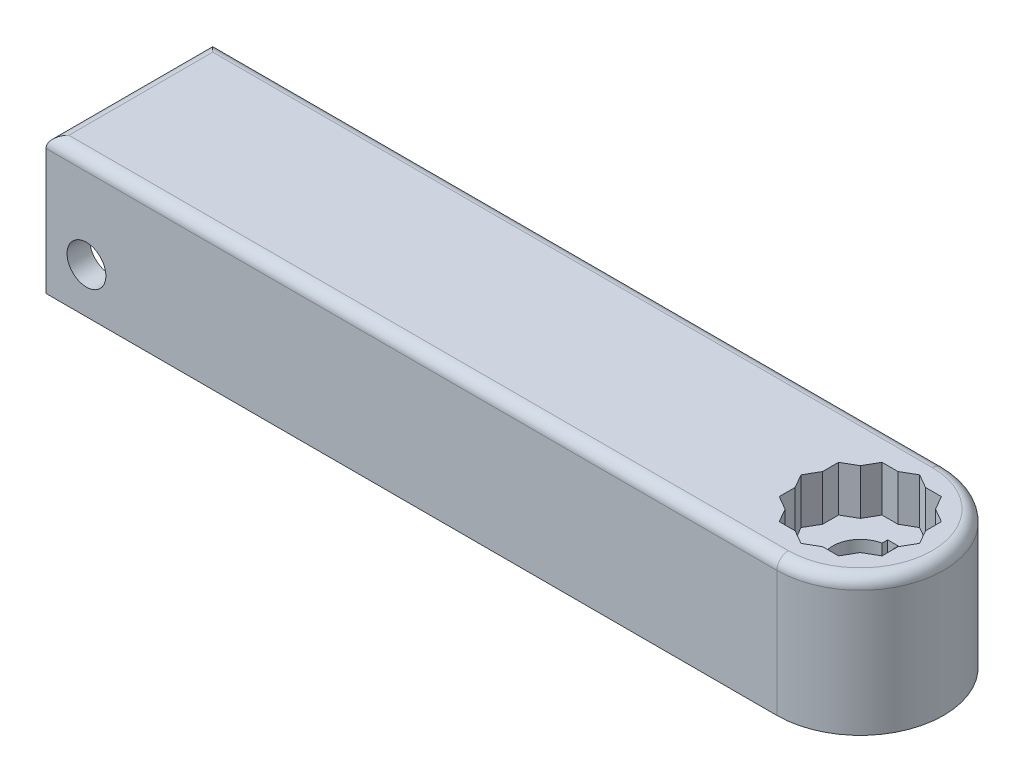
ISO-10303-21;
HEADER;
FILE_DESCRIPTION(('STEP AP214'),'2;1');
FILE_NAME('part.step','',(''),(''),'','','');
FILE_SCHEMA(('AUTOMOTIVE_DESIGN { 1 0 10303 214 1 1 1 1 }'));
ENDSEC;
DATA;
#1=APPLICATION_CONTEXT('core data for automotive mechanical design processes');
#2=APPLICATION_PROTOCOL_DEFINITION('international standard','automotive_design',2000,#1);
#3=PRODUCT_CONTEXT('',#1,'mechanical');
#4=PRODUCT('Part','Part','',(#3));
#5=PRODUCT_RELATED_PRODUCT_CATEGORY('part','',(#4));
#6=PRODUCT_DEFINITION_FORMATION('','',#4);
#7=PRODUCT_DEFINITION_CONTEXT('part definition',#1,'design');
#8=PRODUCT_DEFINITION('design','',#6,#7);
#9=PRODUCT_DEFINITION_SHAPE('','',#8);
#10=(LENGTH_UNIT() NAMED_UNIT(*) SI_UNIT(.MILLI.,.METRE.));
#11=(NAMED_UNIT(*) PLANE_ANGLE_UNIT() SI_UNIT($,.RADIAN.));
#12=(NAMED_UNIT(*) SI_UNIT($,.STERADIAN.) SOLID_ANGLE_UNIT());
#13=UNCERTAINTY_MEASURE_WITH_UNIT(LENGTH_MEASURE(1.E-05),#10,'distance_accuracy_value','');
#14=(GEOMETRIC_REPRESENTATION_CONTEXT(3) GLOBAL_UNCERTAINTY_ASSIGNED_CONTEXT((#13)) GLOBAL_UNIT_ASSIGNED_CONTEXT((#10,
#11,#12)) REPRESENTATION_CONTEXT('',''));
#15=CARTESIAN_POINT('',(0.,0.,0.));
#16=DIRECTION('',(0.,0.,1.));
#17=DIRECTION('',(1.,0.,0.));
#18=AXIS2_PLACEMENT_3D('',#15,#16,#17);
#19=CARTESIAN_POINT('',(434.975,50.8,-62.8527839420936));
#20=DIRECTION('',(0.5,0.,-0.866025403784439));
#21=DIRECTION('',(-0.866025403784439,0.,-0.5));
#22=AXIS2_PLACEMENT_3D('',#19,#20,#21);
#23=PLANE('',#22);
#24=DIRECTION('',(-0.866025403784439,0.,-0.5));
#25=VECTOR('',#24,1.);
#26=CARTESIAN_POINT('',(434.975,50.8,-62.8527839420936));
#27=LINE('',#26,#25);
#28=CARTESIAN_POINT('',(414.056648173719,50.8,-74.93));
#29=VERTEX_POINT('',#28);
#30=CARTESIAN_POINT('',(406.4,50.8,-79.3505678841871));
#31=VERTEX_POINT('',#30);
#32=EDGE_CURVE('E428',#29,#31,#27,.T.);
#33=ORIENTED_EDGE('',*,*,#32,.F.);
#34=DIRECTION('',(0.,1.,0.));
#35=VECTOR('',#34,1.);
#36=CARTESIAN_POINT('',(414.056648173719,50.8,-74.93));
#37=LINE('',#36,#35);
#38=CARTESIAN_POINT('',(414.056648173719,76.2,-74.93));
#39=VERTEX_POINT('',#38);
#40=EDGE_CURVE('E396',#29,#39,#37,.T.);
#41=ORIENTED_EDGE('',*,*,#40,.T.);
#42=DIRECTION('',(-0.866025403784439,0.,-0.5));
#43=VECTOR('',#42,1.);
#44=CARTESIAN_POINT('',(434.975,76.2,-62.8527839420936));
#45=LINE('',#44,#43);
#46=CARTESIAN_POINT('',(406.4,76.2,-79.3505678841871));
#47=VERTEX_POINT('',#46);
#48=EDGE_CURVE('E423',#39,#47,#45,.T.);
#49=ORIENTED_EDGE('',*,*,#48,.T.);
#50=DIRECTION('',(0.,1.,0.));
#51=VECTOR('',#50,1.);
#52=CARTESIAN_POINT('',(406.4,50.8,-79.3505678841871));
#53=LINE('',#52,#51);
#54=EDGE_CURVE('E448',#31,#47,#53,.T.);
#55=ORIENTED_EDGE('',*,*,#54,.F.);
#56=EDGE_LOOP('',(#33,#41,#49,#55));
#57=FACE_BOUND('',#56,.T.);
#58=ADVANCED_FACE('F31',(#57),#23,.F.);
#59=CARTESIAN_POINT('',(434.975,50.8,-29.8572160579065));
#60=DIRECTION('',(1.,0.,0.));
#61=DIRECTION('',(0.,0.,-1.));
#62=AXIS2_PLACEMENT_3D('',#59,#60,#61);
#63=PLANE('',#62);
#64=DIRECTION('',(0.,0.,-1.));
#65=VECTOR('',#64,1.);
#66=CARTESIAN_POINT('',(434.975,76.2,-29.8572160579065));
#67=LINE('',#66,#65);
#68=CARTESIAN_POINT('',(434.975,76.2,-29.8572160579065));
#69=VERTEX_POINT('',#68);
#70=CARTESIAN_POINT('',(434.975,76.2,-38.6983518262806));
#71=VERTEX_POINT('',#70);
#72=EDGE_CURVE('E469',#69,#71,#67,.T.);
#73=ORIENTED_EDGE('',*,*,#72,.T.);
#74=DIRECTION('',(0.,-1.,0.));
#75=VECTOR('',#74,1.);
#76=CARTESIAN_POINT('',(434.975,50.8,-38.6983518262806));
#77=LINE('',#76,#75);
#78=CARTESIAN_POINT('',(434.975,50.8,-38.6983518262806));
#79=VERTEX_POINT('',#78);
#80=EDGE_CURVE('E420',#71,#79,#77,.T.);
#81=ORIENTED_EDGE('',*,*,#80,.T.);
#82=DIRECTION('',(0.,0.,-1.));
#83=VECTOR('',#82,1.);
#84=CARTESIAN_POINT('',(434.975,50.8,-29.8572160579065));
#85=LINE('',#84,#83);
#86=CARTESIAN_POINT('',(434.975,50.8,-29.8572160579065));
#87=VERTEX_POINT('',#86);
#88=EDGE_CURVE('E445',#87,#79,#85,.T.);
#89=ORIENTED_EDGE('',*,*,#88,.F.);
#90=DIRECTION('',(0.,1.,0.));
#91=VECTOR('',#90,1.);
#92=CARTESIAN_POINT('',(434.975,50.8,-29.8572160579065));
#93=LINE('',#92,#91);
#94=EDGE_CURVE('E476',#87,#69,#93,.T.);
#95=ORIENTED_EDGE('',*,*,#94,.T.);
#96=EDGE_LOOP('',(#73,#81,#89,#95));
#97=FACE_BOUND('',#96,.T.);
#98=ADVANCED_FACE('F622',(#97),#63,.F.);
#99=CARTESIAN_POINT('',(406.4,50.8,-13.359432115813));
#100=DIRECTION('',(0.5,0.,0.866025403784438));
#101=DIRECTION('',(0.866025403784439,0.,-0.5));
#102=AXIS2_PLACEMENT_3D('',#99,#100,#101);
#103=PLANE('',#102);
#104=DIRECTION('',(0.866025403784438,0.,-0.5));
#105=VECTOR('',#104,1.);
#106=CARTESIAN_POINT('',(406.4,50.8,-13.359432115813));
#107=LINE('',#106,#105);
#108=CARTESIAN_POINT('',(427.318351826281,50.8,-25.4366481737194));
#109=VERTEX_POINT('',#108);
#110=EDGE_CURVE('E440',#109,#87,#107,.T.);
#111=ORIENTED_EDGE('',*,*,#110,.F.);
#112=DIRECTION('',(0.,1.,0.));
#113=VECTOR('',#112,1.);
#114=CARTESIAN_POINT('',(427.318351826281,50.8,-25.4366481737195));
#115=LINE('',#114,#113);
#116=CARTESIAN_POINT('',(427.318351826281,76.2,-25.4366481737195));
#117=VERTEX_POINT('',#116);
#118=EDGE_CURVE('E417',#109,#117,#115,.T.);
#119=ORIENTED_EDGE('',*,*,#118,.T.);
#120=DIRECTION('',(0.866025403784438,0.,-0.5));
#121=VECTOR('',#120,1.);
#122=CARTESIAN_POINT('',(406.4,76.2,-13.359432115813));
#123=LINE('',#122,#121);
#124=EDGE_CURVE('E464',#117,#69,#123,.T.);
#125=ORIENTED_EDGE('',*,*,#124,.T.);
#126=ORIENTED_EDGE('',*,*,#94,.F.);
#127=EDGE_LOOP('',(#111,#119,#125,#126));
#128=FACE_BOUND('',#127,.T.);
#129=ADVANCED_FACE('F629',(#128),#103,.F.);
#130=CARTESIAN_POINT('',(377.825,50.8,-29.8572160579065));
#131=DIRECTION('',(-0.5,0.,0.866025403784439));
#132=DIRECTION('',(0.866025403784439,0.,0.5));
#133=AXIS2_PLACEMENT_3D('',#130,#131,#132);
#134=PLANE('',#133);
#135=DIRECTION('',(0.866025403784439,0.,0.5));
#136=VECTOR('',#135,1.);
#137=CARTESIAN_POINT('',(377.825,50.8,-29.8572160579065));
#138=LINE('',#137,#136);
#139=CARTESIAN_POINT('',(398.743351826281,50.8,-17.78));
#140=VERTEX_POINT('',#139);
#141=CARTESIAN_POINT('',(406.4,50.8,-13.359432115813));
#142=VERTEX_POINT('',#141);
#143=EDGE_CURVE('E436',#140,#142,#138,.T.);
#144=ORIENTED_EDGE('',*,*,#143,.F.);
#145=DIRECTION('',(0.,1.,0.));
#146=VECTOR('',#145,1.);
#147=CARTESIAN_POINT('',(398.743351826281,50.8,-17.78));
#148=LINE('',#147,#146);
#149=CARTESIAN_POINT('',(398.743351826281,76.2,-17.78));
#150=VERTEX_POINT('',#149);
#151=EDGE_CURVE('E411',#140,#150,#148,.T.);
#152=ORIENTED_EDGE('',*,*,#151,.T.);
#153=DIRECTION('',(0.866025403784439,0.,0.5));
#154=VECTOR('',#153,1.);
#155=CARTESIAN_POINT('',(377.825,76.2,-29.8572160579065));
#156=LINE('',#155,#154);
#157=CARTESIAN_POINT('',(406.4,76.2,-13.359432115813));
#158=VERTEX_POINT('',#157);
#159=EDGE_CURVE('E460',#150,#158,#156,.T.);
#160=ORIENTED_EDGE('',*,*,#159,.T.);
#161=DIRECTION('',(0.,1.,0.));
#162=VECTOR('',#161,1.);
#163=CARTESIAN_POINT('',(406.4,50.8,-13.359432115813));
#164=LINE('',#163,#162);
#165=EDGE_CURVE('E479',#142,#158,#164,.T.);
#166=ORIENTED_EDGE('',*,*,#165,.F.);
#167=EDGE_LOOP('',(#144,#152,#160,#166));
#168=FACE_BOUND('',#167,.T.);
#169=ADVANCED_FACE('F696',(#168),#134,.F.);
#170=CARTESIAN_POINT('',(377.825,50.8,-62.8527839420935));
#171=DIRECTION('',(-1.,0.,0.));
#172=DIRECTION('',(0.,0.,1.));
#173=AXIS2_PLACEMENT_3D('',#170,#171,#172);
#174=PLANE('',#173);
#175=DIRECTION('',(0.,0.,1.));
#176=VECTOR('',#175,1.);
#177=CARTESIAN_POINT('',(377.825,50.8,-62.8527839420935));
#178=LINE('',#177,#176);
#179=CARTESIAN_POINT('',(377.825,50.8,-38.6983518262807));
#180=VERTEX_POINT('',#179);
#181=CARTESIAN_POINT('',(377.825,50.8,-29.8572160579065));
#182=VERTEX_POINT('',#181);
#183=EDGE_CURVE('E432',#180,#182,#178,.T.);
#184=ORIENTED_EDGE('',*,*,#183,.F.);
#185=DIRECTION('',(0.,1.,0.));
#186=VECTOR('',#185,1.);
#187=CARTESIAN_POINT('',(377.825,50.8,-38.6983518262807));
#188=LINE('',#187,#186);
#189=CARTESIAN_POINT('',(377.825,76.2,-38.6983518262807));
#190=VERTEX_POINT('',#189);
#191=EDGE_CURVE('E405',#180,#190,#188,.T.);
#192=ORIENTED_EDGE('',*,*,#191,.T.);
#193=DIRECTION('',(0.,0.,1.));
#194=VECTOR('',#193,1.);
#195=CARTESIAN_POINT('',(377.825,76.2,-62.8527839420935));
#196=LINE('',#195,#194);
#197=CARTESIAN_POINT('',(377.825,76.2,-29.8572160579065));
#198=VERTEX_POINT('',#197);
#199=EDGE_CURVE('E456',#190,#198,#196,.T.);
#200=ORIENTED_EDGE('',*,*,#199,.T.);
#201=DIRECTION('',(0.,1.,0.));
#202=VECTOR('',#201,1.);
#203=CARTESIAN_POINT('',(377.825,50.8,-29.8572160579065));
#204=LINE('',#203,#202);
#205=EDGE_CURVE('E482',#182,#198,#204,.T.);
#206=ORIENTED_EDGE('',*,*,#205,.F.);
#207=EDGE_LOOP('',(#184,#192,#200,#206));
#208=FACE_BOUND('',#207,.T.);
#209=ADVANCED_FACE('F714',(#208),#174,.F.);
#210=CARTESIAN_POINT('',(406.4,50.8,-79.3505678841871));
#211=DIRECTION('',(-0.500000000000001,0.,-0.866025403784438));
#212=DIRECTION('',(-0.866025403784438,0.,0.500000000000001));
#213=AXIS2_PLACEMENT_3D('',#210,#211,#212);
#214=PLANE('',#213);
#215=DIRECTION('',(-0.866025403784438,0.,0.500000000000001));
#216=VECTOR('',#215,1.);
#217=CARTESIAN_POINT('',(406.4,50.8,-79.3505678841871));
#218=LINE('',#217,#216);
#219=CARTESIAN_POINT('',(385.481648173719,50.8,-67.2733518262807));
#220=VERTEX_POINT('',#219);
#221=CARTESIAN_POINT('',(377.825,50.8,-62.8527839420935));
#222=VERTEX_POINT('',#221);
#223=EDGE_CURVE('E427',#220,#222,#218,.T.);
#224=ORIENTED_EDGE('',*,*,#223,.F.);
#225=DIRECTION('',(0.,1.,0.));
#226=VECTOR('',#225,1.);
#227=CARTESIAN_POINT('',(385.481648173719,50.8,-67.2733518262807));
#228=LINE('',#227,#226);
#229=CARTESIAN_POINT('',(385.481648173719,76.2,-67.2733518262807));
#230=VERTEX_POINT('',#229);
#231=EDGE_CURVE('E399',#220,#230,#228,.T.);
#232=ORIENTED_EDGE('',*,*,#231,.T.);
#233=DIRECTION('',(-0.866025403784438,0.,0.500000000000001));
#234=VECTOR('',#233,1.);
#235=CARTESIAN_POINT('',(406.4,76.2,-79.3505678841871));
#236=LINE('',#235,#234);
#237=CARTESIAN_POINT('',(377.825,76.2,-62.8527839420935));
#238=VERTEX_POINT('',#237);
#239=EDGE_CURVE('E452',#230,#238,#236,.T.);
#240=ORIENTED_EDGE('',*,*,#239,.T.);
#241=DIRECTION('',(0.,1.,0.));
#242=VECTOR('',#241,1.);
#243=CARTESIAN_POINT('',(377.825,50.8,-62.8527839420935));
#244=LINE('',#243,#242);
#245=EDGE_CURVE('E485',#222,#238,#244,.T.);
#246=ORIENTED_EDGE('',*,*,#245,.F.);
#247=EDGE_LOOP('',(#224,#232,#240,#246));
#248=FACE_BOUND('',#247,.T.);
#249=ADVANCED_FACE('F732',(#248),#214,.F.);
#250=CARTESIAN_POINT('',(0.,31.75,-12.7));
#251=DIRECTION('',(0.,1.,0.));
#252=DIRECTION('',(0.,0.,1.));
#253=AXIS2_PLACEMENT_3D('',#250,#251,#252);
#254=PLANE('',#253);
#255=DIRECTION('',(1.,0.,0.));
#256=VECTOR('',#255,1.);
#257=CARTESIAN_POINT('',(0.,31.75,-80.01));
#258=LINE('',#257,#256);
#259=CARTESIAN_POINT('',(0.,31.75,-80.01));
#260=VERTEX_POINT('',#259);
#261=CARTESIAN_POINT('',(13.9830837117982,31.75,-80.01));
#262=VERTEX_POINT('',#261);
#263=EDGE_CURVE('E508',#260,#262,#258,.T.);
#264=ORIENTED_EDGE('',*,*,#263,.T.);
#265=DIRECTION('',(0.,0.,1.));
#266=VECTOR('',#265,1.);
#267=CARTESIAN_POINT('',(13.9830837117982,31.75,-92.71));
#268=LINE('',#267,#266);
#269=CARTESIAN_POINT('',(13.9830837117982,31.75,-12.7));
#270=VERTEX_POINT('',#269);
#271=EDGE_CURVE('E573',#262,#270,#268,.T.);
#272=ORIENTED_EDGE('',*,*,#271,.T.);
#273=DIRECTION('',(-1.,0.,0.));
#274=VECTOR('',#273,1.);
#275=CARTESIAN_POINT('',(0.,31.75,-12.7));
#276=LINE('',#275,#274);
#277=CARTESIAN_POINT('',(0.,31.75,-12.7));
#278=VERTEX_POINT('',#277);
#279=EDGE_CURVE('E514',#270,#278,#276,.T.);
#280=ORIENTED_EDGE('',*,*,#279,.T.);
#281=DIRECTION('',(0.,0.,-1.));
#282=VECTOR('',#281,1.);
#283=CARTESIAN_POINT('',(0.,31.75,-80.01));
#284=LINE('',#283,#282);
#285=EDGE_CURVE('E504',#278,#260,#284,.T.);
#286=ORIENTED_EDGE('',*,*,#285,.T.);
#287=EDGE_LOOP('',(#264,#272,#280,#286));
#288=FACE_BOUND('',#287,.T.);
#289=ADVANCED_FACE('F753',(#288),#254,.F.);
#290=CARTESIAN_POINT('',(0.,76.2,0.));
#291=DIRECTION('',(1.,0.,0.));
#292=DIRECTION('',(0.,0.,-1.));
#293=AXIS2_PLACEMENT_3D('',#290,#291,#292);
#294=PLANE('',#293);
#295=DIRECTION('',(0.,-1.,0.));
#296=VECTOR('',#295,1.);
#297=CARTESIAN_POINT('',(0.,76.2,0.));
#298=LINE('',#297,#296);
#299=CARTESIAN_POINT('',(0.,69.85,0.));
#300=VERTEX_POINT('',#299);
#301=CARTESIAN_POINT('',(0.,0.,0.));
#302=VERTEX_POINT('',#301);
#303=EDGE_CURVE('E568',#300,#302,#298,.T.);
#304=ORIENTED_EDGE('',*,*,#303,.F.);
#305=DIRECTION('',(0.,0.,1.));
#306=VECTOR('',#305,1.);
#307=CARTESIAN_POINT('',(0.,69.85,0.));
#308=LINE('',#307,#306);
#309=CARTESIAN_POINT('',(0.,69.85,-92.71));
#310=VERTEX_POINT('',#309);
#311=EDGE_CURVE('E590',#300,#310,#308,.F.);
#312=ORIENTED_EDGE('',*,*,#311,.T.);
#313=DIRECTION('',(0.,-1.,0.));
#314=VECTOR('',#313,1.);
#315=CARTESIAN_POINT('',(0.,76.2,-92.71));
#316=LINE('',#315,#314);
#317=CARTESIAN_POINT('',(0.,0.,-92.71));
#318=VERTEX_POINT('',#317);
#319=EDGE_CURVE('E562',#310,#318,#316,.T.);
#320=ORIENTED_EDGE('',*,*,#319,.T.);
#321=DIRECTION('',(0.,0.,1.));
#322=VECTOR('',#321,1.);
#323=CARTESIAN_POINT('',(0.,0.,0.));
#324=LINE('',#323,#322);
#325=CARTESIAN_POINT('',(0.,0.,-80.01));
#326=VERTEX_POINT('',#325);
#327=EDGE_CURVE('E550',#318,#326,#324,.T.);
#328=ORIENTED_EDGE('',*,*,#327,.T.);
#329=DIRECTION('',(0.,-1.,0.));
#330=VECTOR('',#329,1.);
#331=CARTESIAN_POINT('',(0.,6.35,-80.01));
#332=LINE('',#331,#330);
#333=EDGE_CURVE('E546',#260,#326,#332,.T.);
#334=ORIENTED_EDGE('',*,*,#333,.F.);
#335=ORIENTED_EDGE('',*,*,#285,.F.);
#336=DIRECTION('',(0.,-1.,0.));
#337=VECTOR('',#336,1.);
#338=CARTESIAN_POINT('',(0.,6.35,-12.7));
#339=LINE('',#338,#337);
#340=CARTESIAN_POINT('',(0.,0.,-12.7));
#341=VERTEX_POINT('',#340);
#342=EDGE_CURVE('E534',#278,#341,#339,.T.);
#343=ORIENTED_EDGE('',*,*,#342,.T.);
#344=EDGE_CURVE('E543',#341,#302,#324,.T.);
#345=ORIENTED_EDGE('',*,*,#344,.T.);
#346=EDGE_LOOP('',(#304,#312,#320,#328,#334,#335,#343,#345));
#347=FACE_BOUND('',#346,.T.);
#348=ADVANCED_FACE('F758',(#347),#294,.F.);
#349=CARTESIAN_POINT('',(0.,76.2,0.));
#350=DIRECTION('',(0.,0.,-1.));
#351=DIRECTION('',(-1.,0.,0.));
#352=AXIS2_PLACEMENT_3D('',#349,#350,#351);
#353=PLANE('',#352);
#354=CARTESIAN_POINT('',(22.4900013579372,25.1025379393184,0.));
#355=DIRECTION('',(0.,0.,1.));
#356=DIRECTION('',(1.,0.,0.));
#357=AXIS2_PLACEMENT_3D('',#354,#355,#356);
#358=CIRCLE('',#357,10.7961289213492);
#359=CARTESIAN_POINT('',(33.2861302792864,25.1025379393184,0.));
#360=VERTEX_POINT('',#359);
#361=EDGE_CURVE('E494',#360,#360,#358,.T.);
#362=ORIENTED_EDGE('',*,*,#361,.F.);
#363=EDGE_LOOP('',(#362));
#364=FACE_BOUND('',#363,.T.);
#365=DIRECTION('',(0.,-1.,0.));
#366=VECTOR('',#365,1.);
#367=CARTESIAN_POINT('',(406.4,76.2,0.));
#368=LINE('',#367,#366);
#369=CARTESIAN_POINT('',(406.4,69.85,0.));
#370=VERTEX_POINT('',#369);
#371=CARTESIAN_POINT('',(406.4,0.,0.));
#372=VERTEX_POINT('',#371);
#373=EDGE_CURVE('E566',#370,#372,#368,.T.);
#374=ORIENTED_EDGE('',*,*,#373,.F.);
#375=DIRECTION('',(1.,0.,0.));
#376=VECTOR('',#375,1.);
#377=CARTESIAN_POINT('',(0.,69.85,0.));
#378=LINE('',#377,#376);
#379=EDGE_CURVE('E592',#370,#300,#378,.F.);
#380=ORIENTED_EDGE('',*,*,#379,.T.);
#381=ORIENTED_EDGE('',*,*,#303,.T.);
#382=DIRECTION('',(1.,0.,0.));
#383=VECTOR('',#382,1.);
#384=CARTESIAN_POINT('',(0.,0.,0.));
#385=LINE('',#384,#383);
#386=EDGE_CURVE('E553',#302,#372,#385,.T.);
#387=ORIENTED_EDGE('',*,*,#386,.T.);
#388=EDGE_LOOP('',(#374,#380,#381,#387));
#389=FACE_BOUND('',#388,.T.);
#390=ADVANCED_FACE('F908',(#364,#389),#353,.F.);
#391=CARTESIAN_POINT('',(406.4,76.2,-46.355));
#392=DIRECTION('',(0.,-1.,0.));
#393=DIRECTION('',(0.,0.,-1.));
#394=AXIS2_PLACEMENT_3D('',#391,#392,#393);
#395=CYLINDRICAL_SURFACE('',#394,46.355);
#396=DIRECTION('',(0.,-1.,0.));
#397=VECTOR('',#396,1.);
#398=CARTESIAN_POINT('',(406.4,76.2,-92.71));
#399=LINE('',#398,#397);
#400=CARTESIAN_POINT('',(406.4,69.85,-92.71));
#401=VERTEX_POINT('',#400);
#402=CARTESIAN_POINT('',(406.4,0.,-92.71));
#403=VERTEX_POINT('',#402);
#404=EDGE_CURVE('E564',#401,#403,#399,.T.);
#405=ORIENTED_EDGE('',*,*,#404,.F.);
#406=CARTESIAN_POINT('',(406.4,69.85,-46.355));
#407=DIRECTION('',(0.,-1.,0.));
#408=DIRECTION('',(0.,0.,-1.));
#409=AXIS2_PLACEMENT_3D('',#406,#407,#408);
#410=CIRCLE('',#409,46.355);
#411=EDGE_CURVE('E588',#401,#370,#410,.T.);
#412=ORIENTED_EDGE('',*,*,#411,.T.);
#413=ORIENTED_EDGE('',*,*,#373,.T.);
#414=CARTESIAN_POINT('',(406.4,0.,-46.355));
#415=DIRECTION('',(0.,1.,0.));
#416=DIRECTION('',(0.,0.,-1.));
#417=AXIS2_PLACEMENT_3D('',#414,#415,#416);
#418=CIRCLE('',#417,46.355);
#419=EDGE_CURVE('E556',#372,#403,#418,.T.);
#420=ORIENTED_EDGE('',*,*,#419,.T.);
#421=EDGE_LOOP('',(#405,#412,#413,#420));
#422=FACE_BOUND('',#421,.T.);
#423=ADVANCED_FACE('F904',(#422),#395,.T.);
#424=CARTESIAN_POINT('',(0.,76.2,-92.71));
#425=DIRECTION('',(0.,0.,1.));
#426=DIRECTION('',(1.,0.,0.));
#427=AXIS2_PLACEMENT_3D('',#424,#425,#426);
#428=PLANE('',#427);
#429=CARTESIAN_POINT('',(22.4900013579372,25.1025379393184,-92.71));
#430=DIRECTION('',(0.,0.,1.));
#431=DIRECTION('',(1.,0.,0.));
#432=AXIS2_PLACEMENT_3D('',#429,#430,#431);
#433=CIRCLE('',#432,10.7961289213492);
#434=CARTESIAN_POINT('',(33.2861302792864,25.1025379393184,-92.71));
#435=VERTEX_POINT('',#434);
#436=EDGE_CURVE('E490',#435,#435,#433,.T.);
#437=ORIENTED_EDGE('',*,*,#436,.T.);
#438=EDGE_LOOP('',(#437));
#439=FACE_BOUND('',#438,.T.);
#440=ORIENTED_EDGE('',*,*,#319,.F.);
#441=DIRECTION('',(-1.,0.,0.));
#442=VECTOR('',#441,1.);
#443=CARTESIAN_POINT('',(0.,69.85,-92.71));
#444=LINE('',#443,#442);
#445=EDGE_CURVE('E585',#310,#401,#444,.F.);
#446=ORIENTED_EDGE('',*,*,#445,.T.);
#447=ORIENTED_EDGE('',*,*,#404,.T.);
#448=DIRECTION('',(-1.,0.,0.));
#449=VECTOR('',#448,1.);
#450=CARTESIAN_POINT('',(0.,0.,-92.71));
#451=LINE('',#450,#449);
#452=EDGE_CURVE('E559',#403,#318,#451,.T.);
#453=ORIENTED_EDGE('',*,*,#452,.T.);
#454=EDGE_LOOP('',(#440,#446,#447,#453));
#455=FACE_BOUND('',#454,.T.);
#456=ADVANCED_FACE('F899',(#439,#455),#428,.F.);
#457=CARTESIAN_POINT('',(406.4,76.2,-46.355));
#458=DIRECTION('',(0.,-1.,0.));
#459=DIRECTION('',(0.,0.,-1.));
#460=AXIS2_PLACEMENT_3D('',#457,#458,#459);
#461=PLANE('',#460);
#462=ORIENTED_EDGE('',*,*,#124,.F.);
#463=DIRECTION('',(0.499999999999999,0.,-0.866025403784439));
#464=VECTOR('',#463,1.);
#465=CARTESIAN_POINT('',(422.897783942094,76.2,-17.78));
#466=LINE('',#465,#464);
#467=CARTESIAN_POINT('',(422.897783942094,76.2,-17.78));
#468=VERTEX_POINT('',#467);
#469=EDGE_CURVE('E353',#468,#117,#466,.T.);
#470=ORIENTED_EDGE('',*,*,#469,.F.);
#471=DIRECTION('',(1.,0.,0.));
#472=VECTOR('',#471,1.);
#473=CARTESIAN_POINT('',(389.902216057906,76.2,-17.78));
#474=LINE('',#473,#472);
#475=CARTESIAN_POINT('',(414.056648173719,76.2,-17.78));
#476=VERTEX_POINT('',#475);
#477=EDGE_CURVE('E367',#476,#468,#474,.T.);
#478=ORIENTED_EDGE('',*,*,#477,.F.);
#479=EDGE_CURVE('E465',#158,#476,#123,.T.);
#480=ORIENTED_EDGE('',*,*,#479,.F.);
#481=ORIENTED_EDGE('',*,*,#159,.F.);
#482=CARTESIAN_POINT('',(389.902216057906,76.2,-17.78));
#483=VERTEX_POINT('',#482);
#484=EDGE_CURVE('E368',#483,#150,#474,.T.);
#485=ORIENTED_EDGE('',*,*,#484,.F.);
#486=DIRECTION('',(0.5,0.,0.866025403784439));
#487=VECTOR('',#486,1.);
#488=CARTESIAN_POINT('',(373.404432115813,76.2,-46.355));
#489=LINE('',#488,#487);
#490=CARTESIAN_POINT('',(385.481648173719,76.2,-25.4366481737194));
#491=VERTEX_POINT('',#490);
#492=EDGE_CURVE('E364',#491,#483,#489,.T.);
#493=ORIENTED_EDGE('',*,*,#492,.F.);
#494=EDGE_CURVE('E461',#198,#491,#156,.T.);
#495=ORIENTED_EDGE('',*,*,#494,.F.);
#496=ORIENTED_EDGE('',*,*,#199,.F.);
#497=CARTESIAN_POINT('',(373.404432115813,76.2,-46.355));
#498=VERTEX_POINT('',#497);
#499=EDGE_CURVE('E365',#498,#190,#489,.T.);
#500=ORIENTED_EDGE('',*,*,#499,.F.);
#501=DIRECTION('',(-0.500000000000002,0.,0.866025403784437));
#502=VECTOR('',#501,1.);
#503=CARTESIAN_POINT('',(389.902216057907,76.2,-74.93));
#504=LINE('',#503,#502);
#505=CARTESIAN_POINT('',(377.825,76.2,-54.0116481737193));
#506=VERTEX_POINT('',#505);
#507=EDGE_CURVE('E361',#506,#498,#504,.T.);
#508=ORIENTED_EDGE('',*,*,#507,.F.);
#509=EDGE_CURVE('E457',#238,#506,#196,.T.);
#510=ORIENTED_EDGE('',*,*,#509,.F.);
#511=ORIENTED_EDGE('',*,*,#239,.F.);
#512=CARTESIAN_POINT('',(389.902216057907,76.2,-74.93));
#513=VERTEX_POINT('',#512);
#514=EDGE_CURVE('E362',#513,#230,#504,.T.);
#515=ORIENTED_EDGE('',*,*,#514,.F.);
#516=DIRECTION('',(-1.,0.,0.));
#517=VECTOR('',#516,1.);
#518=CARTESIAN_POINT('',(422.897783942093,76.2,-74.93));
#519=LINE('',#518,#517);
#520=CARTESIAN_POINT('',(398.743351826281,76.2,-74.93));
#521=VERTEX_POINT('',#520);
#522=EDGE_CURVE('E358',#521,#513,#519,.T.);
#523=ORIENTED_EDGE('',*,*,#522,.F.);
#524=EDGE_CURVE('E453',#47,#521,#236,.T.);
#525=ORIENTED_EDGE('',*,*,#524,.F.);
#526=ORIENTED_EDGE('',*,*,#48,.F.);
#527=CARTESIAN_POINT('',(422.897783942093,76.2,-74.93));
#528=VERTEX_POINT('',#527);
#529=EDGE_CURVE('E359',#528,#39,#519,.T.);
#530=ORIENTED_EDGE('',*,*,#529,.F.);
#531=DIRECTION('',(-0.5,0.,-0.866025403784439));
#532=VECTOR('',#531,1.);
#533=CARTESIAN_POINT('',(439.395567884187,76.2,-46.355));
#534=LINE('',#533,#532);
#535=CARTESIAN_POINT('',(427.318351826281,76.2,-67.2733518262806));
#536=VERTEX_POINT('',#535);
#537=EDGE_CURVE('E355',#536,#528,#534,.T.);
#538=ORIENTED_EDGE('',*,*,#537,.F.);
#539=CARTESIAN_POINT('',(434.975,76.2,-62.8527839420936));
#540=VERTEX_POINT('',#539);
#541=EDGE_CURVE('E449',#540,#536,#45,.T.);
#542=ORIENTED_EDGE('',*,*,#541,.F.);
#543=CARTESIAN_POINT('',(434.975,76.2,-54.0116481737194));
#544=VERTEX_POINT('',#543);
#545=EDGE_CURVE('E468',#544,#540,#67,.T.);
#546=ORIENTED_EDGE('',*,*,#545,.F.);
#547=CARTESIAN_POINT('',(439.395567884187,76.2,-46.355));
#548=VERTEX_POINT('',#547);
#549=EDGE_CURVE('E356',#548,#544,#534,.T.);
#550=ORIENTED_EDGE('',*,*,#549,.F.);
#551=EDGE_CURVE('E330',#71,#548,#466,.T.);
#552=ORIENTED_EDGE('',*,*,#551,.F.);
#553=ORIENTED_EDGE('',*,*,#72,.F.);
#554=EDGE_LOOP('',(#462,#470,#478,#480,#481,#485,#493,#495,#496,#500,#508,#510,#511,#515,#523,
#525,#526,#530,#538,#542,#546,#550,#552,#553));
#555=FACE_BOUND('',#554,.T.);
#556=CARTESIAN_POINT('',(406.4,76.2,-46.355));
#557=DIRECTION('',(0.,-1.,0.));
#558=DIRECTION('',(0.,0.,-1.));
#559=AXIS2_PLACEMENT_3D('',#556,#557,#558);
#560=CIRCLE('',#559,40.005);
#561=CARTESIAN_POINT('',(406.4,76.2,-6.35));
#562=VERTEX_POINT('',#561);
#563=CARTESIAN_POINT('',(406.4,76.2,-86.36));
#564=VERTEX_POINT('',#563);
#565=EDGE_CURVE('E580',#562,#564,#560,.F.);
#566=ORIENTED_EDGE('',*,*,#565,.T.);
#567=DIRECTION('',(-1.,0.,0.));
#568=VECTOR('',#567,1.);
#569=CARTESIAN_POINT('',(406.4,76.2,-86.36));
#570=LINE('',#569,#568);
#571=CARTESIAN_POINT('',(6.35000000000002,76.2,-86.36));
#572=VERTEX_POINT('',#571);
#573=EDGE_CURVE('E582',#564,#572,#570,.T.);
#574=ORIENTED_EDGE('',*,*,#573,.T.);
#575=DIRECTION('',(0.,0.,1.));
#576=VECTOR('',#575,1.);
#577=CARTESIAN_POINT('',(6.35000000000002,76.2,-46.355));
#578=LINE('',#577,#576);
#579=CARTESIAN_POINT('',(6.35000000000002,76.2,-6.35));
#580=VERTEX_POINT('',#579);
#581=EDGE_CURVE('E578',#572,#580,#578,.T.);
#582=ORIENTED_EDGE('',*,*,#581,.T.);
#583=DIRECTION('',(1.,0.,0.));
#584=VECTOR('',#583,1.);
#585=CARTESIAN_POINT('',(406.4,76.2,-6.35));
#586=LINE('',#585,#584);
#587=EDGE_CURVE('E576',#580,#562,#586,.T.);
#588=ORIENTED_EDGE('',*,*,#587,.T.);
#589=EDGE_LOOP('',(#566,#574,#582,#588));
#590=FACE_BOUND('',#589,.T.);
#591=ADVANCED_FACE('F655',(#555,#590),#461,.F.);
#592=CARTESIAN_POINT('',(406.4,0.,-46.355));
#593=DIRECTION('',(0.,-1.,0.));
#594=DIRECTION('',(0.,0.,-1.));
#595=AXIS2_PLACEMENT_3D('',#592,#593,#594);
#596=PLANE('',#595);
#597=DIRECTION('',(-1.,0.,0.));
#598=VECTOR('',#597,1.);
#599=CARTESIAN_POINT('',(406.4,0.,-12.7));
#600=LINE('',#599,#598);
#601=CARTESIAN_POINT('',(406.4,0.,-12.7));
#602=VERTEX_POINT('',#601);
#603=EDGE_CURVE('E523',#602,#341,#600,.T.);
#604=ORIENTED_EDGE('',*,*,#603,.F.);
#605=CARTESIAN_POINT('',(406.4,0.,-46.355));
#606=DIRECTION('',(0.,-1.,0.));
#607=DIRECTION('',(0.,0.,-1.));
#608=AXIS2_PLACEMENT_3D('',#605,#606,#607);
#609=CIRCLE('',#608,33.655);
#610=CARTESIAN_POINT('',(406.4,0.,-80.01));
#611=VERTEX_POINT('',#610);
#612=EDGE_CURVE('E529',#611,#602,#609,.T.);
#613=ORIENTED_EDGE('',*,*,#612,.F.);
#614=DIRECTION('',(1.,0.,0.));
#615=VECTOR('',#614,1.);
#616=CARTESIAN_POINT('',(0.,0.,-80.01));
#617=LINE('',#616,#615);
#618=EDGE_CURVE('E536',#326,#611,#617,.T.);
#619=ORIENTED_EDGE('',*,*,#618,.F.);
#620=ORIENTED_EDGE('',*,*,#327,.F.);
#621=ORIENTED_EDGE('',*,*,#452,.F.);
#622=ORIENTED_EDGE('',*,*,#419,.F.);
#623=ORIENTED_EDGE('',*,*,#386,.F.);
#624=ORIENTED_EDGE('',*,*,#344,.F.);
#625=EDGE_LOOP('',(#604,#613,#619,#620,#621,#622,#623,#624));
#626=FACE_BOUND('',#625,.T.);
#627=ADVANCED_FACE('F877',(#626),#596,.T.);
#628=CARTESIAN_POINT('',(406.4,6.35,-12.7));
#629=DIRECTION('',(0.,0.,1.));
#630=DIRECTION('',(1.,0.,0.));
#631=AXIS2_PLACEMENT_3D('',#628,#629,#630);
#632=PLANE('',#631);
#633=ORIENTED_EDGE('',*,*,#279,.F.);
#634=CARTESIAN_POINT('',(22.4900013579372,25.1025379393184,-12.7));
#635=DIRECTION('',(0.,0.,1.));
#636=DIRECTION('',(1.,0.,0.));
#637=AXIS2_PLACEMENT_3D('',#634,#635,#636);
#638=CIRCLE('',#637,10.7961289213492);
#639=CARTESIAN_POINT('',(30.9969190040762,31.75,-12.7));
#640=VERTEX_POINT('',#639);
#641=EDGE_CURVE('E500',#270,#640,#638,.T.);
#642=ORIENTED_EDGE('',*,*,#641,.T.);
#643=CARTESIAN_POINT('',(359.043879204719,31.75,-12.7));
#644=VERTEX_POINT('',#643);
#645=EDGE_CURVE('E515',#644,#640,#276,.T.);
#646=ORIENTED_EDGE('',*,*,#645,.F.);
#647=DIRECTION('',(0.,-1.,0.));
#648=VECTOR('',#647,1.);
#649=CARTESIAN_POINT('',(359.043879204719,31.75,-12.7));
#650=LINE('',#649,#648);
#651=CARTESIAN_POINT('',(359.043879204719,6.35,-12.7));
#652=VERTEX_POINT('',#651);
#653=EDGE_CURVE('E521',#644,#652,#650,.T.);
#654=ORIENTED_EDGE('',*,*,#653,.T.);
#655=DIRECTION('',(-1.,0.,0.));
#656=VECTOR('',#655,1.);
#657=CARTESIAN_POINT('',(406.4,6.35,-12.7));
#658=LINE('',#657,#656);
#659=CARTESIAN_POINT('',(406.4,6.35,-12.7));
#660=VERTEX_POINT('',#659);
#661=EDGE_CURVE('E525',#660,#652,#658,.T.);
#662=ORIENTED_EDGE('',*,*,#661,.F.);
#663=DIRECTION('',(0.,-1.,0.));
#664=VECTOR('',#663,1.);
#665=CARTESIAN_POINT('',(406.4,6.35,-12.7));
#666=LINE('',#665,#664);
#667=EDGE_CURVE('E541',#660,#602,#666,.T.);
#668=ORIENTED_EDGE('',*,*,#667,.T.);
#669=ORIENTED_EDGE('',*,*,#603,.T.);
#670=ORIENTED_EDGE('',*,*,#342,.F.);
#671=EDGE_LOOP('',(#633,#642,#646,#654,#662,#668,#669,#670));
#672=FACE_BOUND('',#671,.T.);
#673=ADVANCED_FACE('F864',(#672),#632,.F.);
#674=CARTESIAN_POINT('',(406.4,6.35,-46.355));
#675=DIRECTION('',(0.,-1.,0.));
#676=DIRECTION('',(0.,0.,-1.));
#677=AXIS2_PLACEMENT_3D('',#674,#675,#676);
#678=CYLINDRICAL_SURFACE('',#677,33.655);
#679=ORIENTED_EDGE('',*,*,#612,.T.);
#680=ORIENTED_EDGE('',*,*,#667,.F.);
#681=CARTESIAN_POINT('',(406.4,6.35,-46.355));
#682=DIRECTION('',(0.,-1.,0.));
#683=DIRECTION('',(0.,0.,-1.));
#684=AXIS2_PLACEMENT_3D('',#681,#682,#683);
#685=CIRCLE('',#684,33.655);
#686=CARTESIAN_POINT('',(406.4,6.35,-80.01));
#687=VERTEX_POINT('',#686);
#688=EDGE_CURVE('E531',#687,#660,#685,.T.);
#689=ORIENTED_EDGE('',*,*,#688,.F.);
#690=DIRECTION('',(0.,-1.,0.));
#691=VECTOR('',#690,1.);
#692=CARTESIAN_POINT('',(406.4,6.35,-80.01));
#693=LINE('',#692,#691);
#694=EDGE_CURVE('E544',#687,#611,#693,.T.);
#695=ORIENTED_EDGE('',*,*,#694,.T.);
#696=EDGE_LOOP('',(#679,#680,#689,#695));
#697=FACE_BOUND('',#696,.T.);
#698=ADVANCED_FACE('F860',(#697),#678,.F.);
#699=CARTESIAN_POINT('',(0.,6.35,-80.01));
#700=DIRECTION('',(0.,0.,-1.));
#701=DIRECTION('',(-1.,0.,0.));
#702=AXIS2_PLACEMENT_3D('',#699,#700,#701);
#703=PLANE('',#702);
#704=CARTESIAN_POINT('',(30.9969190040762,31.75,-80.01));
#705=VERTEX_POINT('',#704);
#706=CARTESIAN_POINT('',(359.043879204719,31.75,-80.01));
#707=VERTEX_POINT('',#706);
#708=EDGE_CURVE('E507',#705,#707,#258,.T.);
#709=ORIENTED_EDGE('',*,*,#708,.F.);
#710=CARTESIAN_POINT('',(22.4900013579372,25.1025379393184,-80.01));
#711=DIRECTION('',(0.,0.,-1.));
#712=DIRECTION('',(-1.,0.,0.));
#713=AXIS2_PLACEMENT_3D('',#710,#711,#712);
#714=CIRCLE('',#713,10.7961289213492);
#715=EDGE_CURVE('E493',#705,#262,#714,.T.);
#716=ORIENTED_EDGE('',*,*,#715,.T.);
#717=ORIENTED_EDGE('',*,*,#263,.F.);
#718=ORIENTED_EDGE('',*,*,#333,.T.);
#719=ORIENTED_EDGE('',*,*,#618,.T.);
#720=ORIENTED_EDGE('',*,*,#694,.F.);
#721=DIRECTION('',(1.,0.,0.));
#722=VECTOR('',#721,1.);
#723=CARTESIAN_POINT('',(0.,6.35,-80.01));
#724=LINE('',#723,#722);
#725=CARTESIAN_POINT('',(359.043879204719,6.35,-80.01));
#726=VERTEX_POINT('',#725);
#727=EDGE_CURVE('E528',#726,#687,#724,.T.);
#728=ORIENTED_EDGE('',*,*,#727,.F.);
#729=DIRECTION('',(0.,-1.,0.));
#730=VECTOR('',#729,1.);
#731=CARTESIAN_POINT('',(359.043879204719,31.75,-80.01));
#732=LINE('',#731,#730);
#733=EDGE_CURVE('E518',#707,#726,#732,.T.);
#734=ORIENTED_EDGE('',*,*,#733,.F.);
#735=EDGE_LOOP('',(#709,#716,#717,#718,#719,#720,#728,#734));
#736=FACE_BOUND('',#735,.T.);
#737=ADVANCED_FACE('F816',(#736),#703,.F.);
#738=CARTESIAN_POINT('',(406.4,6.35,-46.355));
#739=DIRECTION('',(0.,-1.,0.));
#740=DIRECTION('',(0.,0.,-1.));
#741=AXIS2_PLACEMENT_3D('',#738,#739,#740);
#742=PLANE('',#741);
#743=CARTESIAN_POINT('',(406.4,6.35,-46.355));
#744=DIRECTION('',(0.,-1.,0.));
#745=DIRECTION('',(0.,0.,-1.));
#746=AXIS2_PLACEMENT_3D('',#743,#744,#745);
#747=CIRCLE('',#746,6.64249795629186);
#748=CARTESIAN_POINT('',(406.4,6.35,-39.7125020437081));
#749=VERTEX_POINT('',#748);
#750=EDGE_CURVE('E319',#749,#749,#747,.T.);
#751=ORIENTED_EDGE('',*,*,#750,.F.);
#752=EDGE_LOOP('',(#751));
#753=FACE_BOUND('',#752,.T.);
#754=DIRECTION('',(0.,0.,1.));
#755=VECTOR('',#754,1.);
#756=CARTESIAN_POINT('',(359.043879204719,6.35,-80.01));
#757=LINE('',#756,#755);
#758=EDGE_CURVE('E503',#726,#652,#757,.T.);
#759=ORIENTED_EDGE('',*,*,#758,.F.);
#760=ORIENTED_EDGE('',*,*,#727,.T.);
#761=ORIENTED_EDGE('',*,*,#688,.T.);
#762=ORIENTED_EDGE('',*,*,#661,.T.);
#763=EDGE_LOOP('',(#759,#760,#761,#762));
#764=FACE_BOUND('',#763,.T.);
#765=ADVANCED_FACE('F810',(#753,#764),#742,.T.);
#766=CARTESIAN_POINT('',(359.043879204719,31.75,-80.01));
#767=DIRECTION('',(1.,0.,0.));
#768=DIRECTION('',(0.,0.,-1.));
#769=AXIS2_PLACEMENT_3D('',#766,#767,#768);
#770=PLANE('',#769);
#771=ORIENTED_EDGE('',*,*,#758,.T.);
#772=ORIENTED_EDGE('',*,*,#653,.F.);
#773=DIRECTION('',(0.,0.,1.));
#774=VECTOR('',#773,1.);
#775=CARTESIAN_POINT('',(359.043879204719,31.75,-80.01));
#776=LINE('',#775,#774);
#777=EDGE_CURVE('E511',#707,#644,#776,.T.);
#778=ORIENTED_EDGE('',*,*,#777,.F.);
#779=ORIENTED_EDGE('',*,*,#733,.T.);
#780=EDGE_LOOP('',(#771,#772,#778,#779));
#781=FACE_BOUND('',#780,.T.);
#782=ADVANCED_FACE('F815',(#781),#770,.F.);
#783=ORIENTED_EDGE('',*,*,#645,.T.);
#784=DIRECTION('',(0.,0.,1.));
#785=VECTOR('',#784,1.);
#786=CARTESIAN_POINT('',(30.9969190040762,31.75,-92.71));
#787=LINE('',#786,#785);
#788=EDGE_CURVE('E570',#640,#705,#787,.F.);
#789=ORIENTED_EDGE('',*,*,#788,.T.);
#790=ORIENTED_EDGE('',*,*,#708,.T.);
#791=ORIENTED_EDGE('',*,*,#777,.T.);
#792=EDGE_LOOP('',(#783,#789,#790,#791));
#793=FACE_BOUND('',#792,.T.);
#794=ADVANCED_FACE('F761',(#793),#254,.F.);
#795=CARTESIAN_POINT('',(22.4900013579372,25.1025379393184,-92.71));
#796=DIRECTION('',(0.,0.,1.));
#797=DIRECTION('',(1.,0.,0.));
#798=AXIS2_PLACEMENT_3D('',#795,#796,#797);
#799=CYLINDRICAL_SURFACE('',#798,10.7961289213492);
#800=ORIENTED_EDGE('',*,*,#361,.T.);
#801=EDGE_LOOP('',(#800));
#802=FACE_BOUND('',#801,.T.);
#803=ORIENTED_EDGE('',*,*,#436,.F.);
#804=EDGE_LOOP('',(#803));
#805=FACE_BOUND('',#804,.T.);
#806=ORIENTED_EDGE('',*,*,#715,.F.);
#807=ORIENTED_EDGE('',*,*,#788,.F.);
#808=ORIENTED_EDGE('',*,*,#641,.F.);
#809=ORIENTED_EDGE('',*,*,#271,.F.);
#810=EDGE_LOOP('',(#806,#807,#808,#809));
#811=FACE_BOUND('',#810,.T.);
#812=ADVANCED_FACE('F880',(#802,#805,#811),#799,.F.);
#813=CARTESIAN_POINT('',(406.4,69.85,-6.35));
#814=DIRECTION('',(1.,0.,0.));
#815=DIRECTION('',(0.,0.,-1.));
#816=AXIS2_PLACEMENT_3D('',#813,#814,#815);
#817=CYLINDRICAL_SURFACE('',#816,6.35);
#818=CARTESIAN_POINT('',(6.35000000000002,69.85,-6.35));
#819=DIRECTION('',(0.707106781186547,0.,0.707106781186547));
#820=DIRECTION('',(0.707106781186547,0.,-0.707106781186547));
#821=AXIS2_PLACEMENT_3D('',#818,#819,#820);
#822=ELLIPSE('',#821,8.98025612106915,6.35);
#823=EDGE_CURVE('E598',#300,#580,#822,.F.);
#824=ORIENTED_EDGE('',*,*,#823,.F.);
#825=ORIENTED_EDGE('',*,*,#379,.F.);
#826=CARTESIAN_POINT('',(406.4,69.85,-6.35));
#827=DIRECTION('',(1.,0.,0.));
#828=DIRECTION('',(0.,0.,-1.));
#829=AXIS2_PLACEMENT_3D('',#826,#827,#828);
#830=CIRCLE('',#829,6.35);
#831=EDGE_CURVE('E497',#562,#370,#830,.T.);
#832=ORIENTED_EDGE('',*,*,#831,.F.);
#833=ORIENTED_EDGE('',*,*,#587,.F.);
#834=EDGE_LOOP('',(#824,#825,#832,#833));
#835=FACE_BOUND('',#834,.T.);
#836=ADVANCED_FACE('F33',(#835),#817,.T.);
#837=CARTESIAN_POINT('',(406.4,69.85,-46.355));
#838=DIRECTION('',(0.,-1.,0.));
#839=DIRECTION('',(0.,0.,-1.));
#840=AXIS2_PLACEMENT_3D('',#837,#838,#839);
#841=TOROIDAL_SURFACE('',#840,40.005,6.35);
#842=ORIENTED_EDGE('',*,*,#831,.T.);
#843=ORIENTED_EDGE('',*,*,#411,.F.);
#844=CARTESIAN_POINT('',(406.4,69.85,-86.36));
#845=DIRECTION('',(-1.,0.,0.));
#846=DIRECTION('',(0.,0.,1.));
#847=AXIS2_PLACEMENT_3D('',#844,#845,#846);
#848=CIRCLE('',#847,6.35);
#849=EDGE_CURVE('E596',#564,#401,#848,.T.);
#850=ORIENTED_EDGE('',*,*,#849,.F.);
#851=ORIENTED_EDGE('',*,*,#565,.F.);
#852=EDGE_LOOP('',(#842,#843,#850,#851));
#853=FACE_BOUND('',#852,.T.);
#854=ADVANCED_FACE('F887',(#853),#841,.T.);
#855=CARTESIAN_POINT('',(6.35000000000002,69.85,-46.355));
#856=DIRECTION('',(0.,0.,1.));
#857=DIRECTION('',(1.,0.,0.));
#858=AXIS2_PLACEMENT_3D('',#855,#856,#857);
#859=CYLINDRICAL_SURFACE('',#858,6.35);
#860=ORIENTED_EDGE('',*,*,#823,.T.);
#861=ORIENTED_EDGE('',*,*,#581,.F.);
#862=CARTESIAN_POINT('',(6.35000000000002,69.85,-86.36));
#863=DIRECTION('',(-0.707106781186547,0.,0.707106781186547));
#864=DIRECTION('',(0.707106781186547,0.,0.707106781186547));
#865=AXIS2_PLACEMENT_3D('',#862,#863,#864);
#866=ELLIPSE('',#865,8.98025612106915,6.35);
#867=EDGE_CURVE('E475',#310,#572,#866,.F.);
#868=ORIENTED_EDGE('',*,*,#867,.F.);
#869=ORIENTED_EDGE('',*,*,#311,.F.);
#870=EDGE_LOOP('',(#860,#861,#868,#869));
#871=FACE_BOUND('',#870,.T.);
#872=ADVANCED_FACE('F645',(#871),#859,.T.);
#873=CARTESIAN_POINT('',(406.4,69.85,-86.36));
#874=DIRECTION('',(-1.,0.,0.));
#875=DIRECTION('',(0.,0.,1.));
#876=AXIS2_PLACEMENT_3D('',#873,#874,#875);
#877=CYLINDRICAL_SURFACE('',#876,6.35);
#878=ORIENTED_EDGE('',*,*,#849,.T.);
#879=ORIENTED_EDGE('',*,*,#445,.F.);
#880=ORIENTED_EDGE('',*,*,#867,.T.);
#881=ORIENTED_EDGE('',*,*,#573,.F.);
#882=EDGE_LOOP('',(#878,#879,#880,#881));
#883=FACE_BOUND('',#882,.T.);
#884=ADVANCED_FACE('F637',(#883),#877,.T.);
#885=ORIENTED_EDGE('',*,*,#541,.T.);
#886=DIRECTION('',(0.,-1.,0.));
#887=VECTOR('',#886,1.);
#888=CARTESIAN_POINT('',(427.318351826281,50.8,-67.2733518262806));
#889=LINE('',#888,#887);
#890=CARTESIAN_POINT('',(427.318351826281,50.8,-67.2733518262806));
#891=VERTEX_POINT('',#890);
#892=EDGE_CURVE('E390',#536,#891,#889,.T.);
#893=ORIENTED_EDGE('',*,*,#892,.T.);
#894=CARTESIAN_POINT('',(434.975,50.8,-62.8527839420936));
#895=VERTEX_POINT('',#894);
#896=EDGE_CURVE('E424',#895,#891,#27,.T.);
#897=ORIENTED_EDGE('',*,*,#896,.F.);
#898=DIRECTION('',(0.,1.,0.));
#899=VECTOR('',#898,1.);
#900=CARTESIAN_POINT('',(434.975,50.8,-62.8527839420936));
#901=LINE('',#900,#899);
#902=EDGE_CURVE('E472',#895,#540,#901,.T.);
#903=ORIENTED_EDGE('',*,*,#902,.T.);
#904=EDGE_LOOP('',(#885,#893,#897,#903));
#905=FACE_BOUND('',#904,.T.);
#906=ADVANCED_FACE('F625',(#905),#23,.F.);
#907=CARTESIAN_POINT('',(434.975,50.8,-54.0116481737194));
#908=VERTEX_POINT('',#907);
#909=EDGE_CURVE('E444',#908,#895,#85,.T.);
#910=ORIENTED_EDGE('',*,*,#909,.F.);
#911=DIRECTION('',(0.,1.,0.));
#912=VECTOR('',#911,1.);
#913=CARTESIAN_POINT('',(434.975,50.8,-54.0116481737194));
#914=LINE('',#913,#912);
#915=EDGE_CURVE('E373',#908,#544,#914,.T.);
#916=ORIENTED_EDGE('',*,*,#915,.T.);
#917=ORIENTED_EDGE('',*,*,#545,.T.);
#918=ORIENTED_EDGE('',*,*,#902,.F.);
#919=EDGE_LOOP('',(#910,#916,#917,#918));
#920=FACE_BOUND('',#919,.T.);
#921=ADVANCED_FACE('F632',(#920),#63,.F.);
#922=ORIENTED_EDGE('',*,*,#479,.T.);
#923=DIRECTION('',(0.,-1.,0.));
#924=VECTOR('',#923,1.);
#925=CARTESIAN_POINT('',(414.056648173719,50.8,-17.78));
#926=LINE('',#925,#924);
#927=CARTESIAN_POINT('',(414.056648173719,50.8,-17.78));
#928=VERTEX_POINT('',#927);
#929=EDGE_CURVE('E414',#476,#928,#926,.T.);
#930=ORIENTED_EDGE('',*,*,#929,.T.);
#931=EDGE_CURVE('E441',#142,#928,#107,.T.);
#932=ORIENTED_EDGE('',*,*,#931,.F.);
#933=ORIENTED_EDGE('',*,*,#165,.T.);
#934=EDGE_LOOP('',(#922,#930,#932,#933));
#935=FACE_BOUND('',#934,.T.);
#936=ADVANCED_FACE('F643',(#935),#103,.F.);
#937=ORIENTED_EDGE('',*,*,#494,.T.);
#938=DIRECTION('',(0.,-1.,0.));
#939=VECTOR('',#938,1.);
#940=CARTESIAN_POINT('',(385.481648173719,50.8,-25.4366481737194));
#941=LINE('',#940,#939);
#942=CARTESIAN_POINT('',(385.481648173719,50.8,-25.4366481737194));
#943=VERTEX_POINT('',#942);
#944=EDGE_CURVE('E408',#491,#943,#941,.T.);
#945=ORIENTED_EDGE('',*,*,#944,.T.);
#946=EDGE_CURVE('E437',#182,#943,#138,.T.);
#947=ORIENTED_EDGE('',*,*,#946,.F.);
#948=ORIENTED_EDGE('',*,*,#205,.T.);
#949=EDGE_LOOP('',(#937,#945,#947,#948));
#950=FACE_BOUND('',#949,.T.);
#951=ADVANCED_FACE('F708',(#950),#134,.F.);
#952=ORIENTED_EDGE('',*,*,#509,.T.);
#953=DIRECTION('',(0.,-1.,0.));
#954=VECTOR('',#953,1.);
#955=CARTESIAN_POINT('',(377.825,50.8,-54.0116481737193));
#956=LINE('',#955,#954);
#957=CARTESIAN_POINT('',(377.825,50.8,-54.0116481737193));
#958=VERTEX_POINT('',#957);
#959=EDGE_CURVE('E402',#506,#958,#956,.T.);
#960=ORIENTED_EDGE('',*,*,#959,.T.);
#961=EDGE_CURVE('E433',#222,#958,#178,.T.);
#962=ORIENTED_EDGE('',*,*,#961,.F.);
#963=ORIENTED_EDGE('',*,*,#245,.T.);
#964=EDGE_LOOP('',(#952,#960,#962,#963));
#965=FACE_BOUND('',#964,.T.);
#966=ADVANCED_FACE('F726',(#965),#174,.F.);
#967=ORIENTED_EDGE('',*,*,#524,.T.);
#968=DIRECTION('',(0.,-1.,0.));
#969=VECTOR('',#968,1.);
#970=CARTESIAN_POINT('',(398.743351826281,50.8,-74.93));
#971=LINE('',#970,#969);
#972=CARTESIAN_POINT('',(398.743351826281,50.8,-74.93));
#973=VERTEX_POINT('',#972);
#974=EDGE_CURVE('E393',#521,#973,#971,.T.);
#975=ORIENTED_EDGE('',*,*,#974,.T.);
#976=EDGE_CURVE('E429',#31,#973,#218,.T.);
#977=ORIENTED_EDGE('',*,*,#976,.F.);
#978=ORIENTED_EDGE('',*,*,#54,.T.);
#979=EDGE_LOOP('',(#967,#975,#977,#978));
#980=FACE_BOUND('',#979,.T.);
#981=ADVANCED_FACE('F744',(#980),#214,.F.);
#982=CARTESIAN_POINT('',(406.4,50.8,-79.3505678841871));
#983=DIRECTION('',(0.,1.,0.));
#984=DIRECTION('',(0.,0.,1.));
#985=AXIS2_PLACEMENT_3D('',#982,#983,#984);
#986=PLANE('',#985);
#987=CARTESIAN_POINT('',(406.4,50.8,-46.355));
#988=DIRECTION('',(0.,1.,0.));
#989=DIRECTION('',(0.,0.,1.));
#990=AXIS2_PLACEMENT_3D('',#987,#988,#989);
#991=CIRCLE('',#990,15.3335555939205);
#992=CARTESIAN_POINT('',(403.41829519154,50.8,-61.3958564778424));
#993=VERTEX_POINT('',#992);
#994=CARTESIAN_POINT('',(409.38170480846,50.8,-61.3958564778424));
#995=VERTEX_POINT('',#994);
#996=EDGE_CURVE('E11',#993,#995,#991,.T.);
#997=ORIENTED_EDGE('',*,*,#996,.F.);
#998=DIRECTION('',(0.,0.,1.));
#999=VECTOR('',#998,1.);
#1000=CARTESIAN_POINT('',(403.41829519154,50.8,-79.3505678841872));
#1001=LINE('',#1000,#999);
#1002=CARTESIAN_POINT('',(403.41829519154,50.8,-64.5708564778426));
#1003=VERTEX_POINT('',#1002);
#1004=EDGE_CURVE('E39',#1003,#993,#1001,.T.);
#1005=ORIENTED_EDGE('',*,*,#1004,.F.);
#1006=DIRECTION('',(-1.,0.,0.));
#1007=VECTOR('',#1006,1.);
#1008=CARTESIAN_POINT('',(406.4,50.8,-64.5708564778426));
#1009=LINE('',#1008,#1007);
#1010=CARTESIAN_POINT('',(409.38170480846,50.8,-64.5708564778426));
#1011=VERTEX_POINT('',#1010);
#1012=EDGE_CURVE('E604',#1011,#1003,#1009,.T.);
#1013=ORIENTED_EDGE('',*,*,#1012,.F.);
#1014=DIRECTION('',(0.,0.,-1.));
#1015=VECTOR('',#1014,1.);
#1016=CARTESIAN_POINT('',(409.38170480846,50.8,-79.3505678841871));
#1017=LINE('',#1016,#1015);
#1018=EDGE_CURVE('E594',#995,#1011,#1017,.T.);
#1019=ORIENTED_EDGE('',*,*,#1018,.F.);
#1020=EDGE_LOOP('',(#997,#1005,#1013,#1019));
#1021=FACE_BOUND('',#1020,.T.);
#1022=ORIENTED_EDGE('',*,*,#896,.T.);
#1023=DIRECTION('',(-0.5,0.,-0.866025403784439));
#1024=VECTOR('',#1023,1.);
#1025=CARTESIAN_POINT('',(439.395567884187,50.8,-46.355));
#1026=LINE('',#1025,#1024);
#1027=CARTESIAN_POINT('',(422.897783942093,50.8,-74.93));
#1028=VERTEX_POINT('',#1027);
#1029=EDGE_CURVE('E337',#891,#1028,#1026,.T.);
#1030=ORIENTED_EDGE('',*,*,#1029,.T.);
#1031=DIRECTION('',(-1.,0.,0.));
#1032=VECTOR('',#1031,1.);
#1033=CARTESIAN_POINT('',(422.897783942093,50.8,-74.93));
#1034=LINE('',#1033,#1032);
#1035=EDGE_CURVE('E341',#1028,#29,#1034,.T.);
#1036=ORIENTED_EDGE('',*,*,#1035,.T.);
#1037=ORIENTED_EDGE('',*,*,#32,.T.);
#1038=ORIENTED_EDGE('',*,*,#976,.T.);
#1039=CARTESIAN_POINT('',(389.902216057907,50.8,-74.93));
#1040=VERTEX_POINT('',#1039);
#1041=EDGE_CURVE('E340',#973,#1040,#1034,.T.);
#1042=ORIENTED_EDGE('',*,*,#1041,.T.);
#1043=DIRECTION('',(-0.500000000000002,0.,0.866025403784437));
#1044=VECTOR('',#1043,1.);
#1045=CARTESIAN_POINT('',(389.902216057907,50.8,-74.93));
#1046=LINE('',#1045,#1044);
#1047=EDGE_CURVE('E344',#1040,#220,#1046,.T.);
#1048=ORIENTED_EDGE('',*,*,#1047,.T.);
#1049=ORIENTED_EDGE('',*,*,#223,.T.);
#1050=ORIENTED_EDGE('',*,*,#961,.T.);
#1051=CARTESIAN_POINT('',(373.404432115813,50.8,-46.355));
#1052=VERTEX_POINT('',#1051);
#1053=EDGE_CURVE('E343',#958,#1052,#1046,.T.);
#1054=ORIENTED_EDGE('',*,*,#1053,.T.);
#1055=DIRECTION('',(0.5,0.,0.866025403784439));
#1056=VECTOR('',#1055,1.);
#1057=CARTESIAN_POINT('',(373.404432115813,50.8,-46.355));
#1058=LINE('',#1057,#1056);
#1059=EDGE_CURVE('E347',#1052,#180,#1058,.T.);
#1060=ORIENTED_EDGE('',*,*,#1059,.T.);
#1061=ORIENTED_EDGE('',*,*,#183,.T.);
#1062=ORIENTED_EDGE('',*,*,#946,.T.);
#1063=CARTESIAN_POINT('',(389.902216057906,50.8,-17.78));
#1064=VERTEX_POINT('',#1063);
#1065=EDGE_CURVE('E346',#943,#1064,#1058,.T.);
#1066=ORIENTED_EDGE('',*,*,#1065,.T.);
#1067=DIRECTION('',(1.,0.,0.));
#1068=VECTOR('',#1067,1.);
#1069=CARTESIAN_POINT('',(389.902216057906,50.8,-17.78));
#1070=LINE('',#1069,#1068);
#1071=EDGE_CURVE('E350',#1064,#140,#1070,.T.);
#1072=ORIENTED_EDGE('',*,*,#1071,.T.);
#1073=ORIENTED_EDGE('',*,*,#143,.T.);
#1074=ORIENTED_EDGE('',*,*,#931,.T.);
#1075=CARTESIAN_POINT('',(422.897783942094,50.8,-17.78));
#1076=VERTEX_POINT('',#1075);
#1077=EDGE_CURVE('E349',#928,#1076,#1070,.T.);
#1078=ORIENTED_EDGE('',*,*,#1077,.T.);
#1079=DIRECTION('',(0.499999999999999,0.,-0.866025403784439));
#1080=VECTOR('',#1079,1.);
#1081=CARTESIAN_POINT('',(422.897783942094,50.8,-17.78));
#1082=LINE('',#1081,#1080);
#1083=EDGE_CURVE('E335',#1076,#109,#1082,.T.);
#1084=ORIENTED_EDGE('',*,*,#1083,.T.);
#1085=ORIENTED_EDGE('',*,*,#110,.T.);
#1086=ORIENTED_EDGE('',*,*,#88,.T.);
#1087=CARTESIAN_POINT('',(439.395567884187,50.8,-46.355));
#1088=VERTEX_POINT('',#1087);
#1089=EDGE_CURVE('E338',#79,#1088,#1082,.T.);
#1090=ORIENTED_EDGE('',*,*,#1089,.T.);
#1091=EDGE_CURVE('E53',#1088,#908,#1026,.T.);
#1092=ORIENTED_EDGE('',*,*,#1091,.T.);
#1093=ORIENTED_EDGE('',*,*,#909,.T.);
#1094=EDGE_LOOP('',(#1022,#1030,#1036,#1037,#1038,#1042,#1048,#1049,#1050,#1054,#1060,#1061,
#1062,#1066,#1072,#1073,#1074,#1078,#1084,#1085,#1086,#1090,#1092,#1093));
#1095=FACE_BOUND('',#1094,.T.);
#1096=ADVANCED_FACE('F610',(#1021,#1095),#986,.T.);
#1097=CARTESIAN_POINT('',(422.897783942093,50.8,-74.93));
#1098=DIRECTION('',(0.,0.,-1.));
#1099=DIRECTION('',(-1.,0.,0.));
#1100=AXIS2_PLACEMENT_3D('',#1097,#1098,#1099);
#1101=PLANE('',#1100);
#1102=ORIENTED_EDGE('',*,*,#522,.T.);
#1103=DIRECTION('',(0.,1.,0.));
#1104=VECTOR('',#1103,1.);
#1105=CARTESIAN_POINT('',(389.902216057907,50.8,-74.93));
#1106=LINE('',#1105,#1104);
#1107=EDGE_CURVE('E380',#1040,#513,#1106,.T.);
#1108=ORIENTED_EDGE('',*,*,#1107,.F.);
#1109=ORIENTED_EDGE('',*,*,#1041,.F.);
#1110=ORIENTED_EDGE('',*,*,#974,.F.);
#1111=EDGE_LOOP('',(#1102,#1108,#1109,#1110));
#1112=FACE_BOUND('',#1111,.T.);
#1113=ADVANCED_FACE('F741',(#1112),#1101,.F.);
#1114=CARTESIAN_POINT('',(389.902216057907,50.8,-74.93));
#1115=DIRECTION('',(-0.866025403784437,0.,-0.500000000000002));
#1116=DIRECTION('',(-0.500000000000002,0.,0.866025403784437));
#1117=AXIS2_PLACEMENT_3D('',#1114,#1115,#1116);
#1118=PLANE('',#1117);
#1119=ORIENTED_EDGE('',*,*,#1047,.F.);
#1120=ORIENTED_EDGE('',*,*,#1107,.T.);
#1121=ORIENTED_EDGE('',*,*,#514,.T.);
#1122=ORIENTED_EDGE('',*,*,#231,.F.);
#1123=EDGE_LOOP('',(#1119,#1120,#1121,#1122));
#1124=FACE_BOUND('',#1123,.T.);
#1125=ADVANCED_FACE('F738',(#1124),#1118,.F.);
#1126=ORIENTED_EDGE('',*,*,#507,.T.);
#1127=DIRECTION('',(0.,1.,0.));
#1128=VECTOR('',#1127,1.);
#1129=CARTESIAN_POINT('',(373.404432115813,50.8,-46.355));
#1130=LINE('',#1129,#1128);
#1131=EDGE_CURVE('E377',#1052,#498,#1130,.T.);
#1132=ORIENTED_EDGE('',*,*,#1131,.F.);
#1133=ORIENTED_EDGE('',*,*,#1053,.F.);
#1134=ORIENTED_EDGE('',*,*,#959,.F.);
#1135=EDGE_LOOP('',(#1126,#1132,#1133,#1134));
#1136=FACE_BOUND('',#1135,.T.);
#1137=ADVANCED_FACE('F723',(#1136),#1118,.F.);
#1138=CARTESIAN_POINT('',(373.404432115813,50.8,-46.355));
#1139=DIRECTION('',(-0.866025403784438,0.,0.5));
#1140=DIRECTION('',(0.5,0.,0.866025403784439));
#1141=AXIS2_PLACEMENT_3D('',#1138,#1139,#1140);
#1142=PLANE('',#1141);
#1143=ORIENTED_EDGE('',*,*,#1059,.F.);
#1144=ORIENTED_EDGE('',*,*,#1131,.T.);
#1145=ORIENTED_EDGE('',*,*,#499,.T.);
#1146=ORIENTED_EDGE('',*,*,#191,.F.);
#1147=EDGE_LOOP('',(#1143,#1144,#1145,#1146));
#1148=FACE_BOUND('',#1147,.T.);
#1149=ADVANCED_FACE('F720',(#1148),#1142,.F.);
#1150=ORIENTED_EDGE('',*,*,#492,.T.);
#1151=DIRECTION('',(0.,1.,0.));
#1152=VECTOR('',#1151,1.);
#1153=CARTESIAN_POINT('',(389.902216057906,50.8,-17.78));
#1154=LINE('',#1153,#1152);
#1155=EDGE_CURVE('E374',#1064,#483,#1154,.T.);
#1156=ORIENTED_EDGE('',*,*,#1155,.F.);
#1157=ORIENTED_EDGE('',*,*,#1065,.F.);
#1158=ORIENTED_EDGE('',*,*,#944,.F.);
#1159=EDGE_LOOP('',(#1150,#1156,#1157,#1158));
#1160=FACE_BOUND('',#1159,.T.);
#1161=ADVANCED_FACE('F705',(#1160),#1142,.F.);
#1162=CARTESIAN_POINT('',(389.902216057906,50.8,-17.78));
#1163=DIRECTION('',(0.,0.,1.));
#1164=DIRECTION('',(1.,0.,0.));
#1165=AXIS2_PLACEMENT_3D('',#1162,#1163,#1164);
#1166=PLANE('',#1165);
#1167=ORIENTED_EDGE('',*,*,#1071,.F.);
#1168=ORIENTED_EDGE('',*,*,#1155,.T.);
#1169=ORIENTED_EDGE('',*,*,#484,.T.);
#1170=ORIENTED_EDGE('',*,*,#151,.F.);
#1171=EDGE_LOOP('',(#1167,#1168,#1169,#1170));
#1172=FACE_BOUND('',#1171,.T.);
#1173=ADVANCED_FACE('F702',(#1172),#1166,.F.);
#1174=ORIENTED_EDGE('',*,*,#477,.T.);
#1175=DIRECTION('',(0.,1.,0.));
#1176=VECTOR('',#1175,1.);
#1177=CARTESIAN_POINT('',(422.897783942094,50.8,-17.78));
#1178=LINE('',#1177,#1176);
#1179=EDGE_CURVE('E370',#1076,#468,#1178,.T.);
#1180=ORIENTED_EDGE('',*,*,#1179,.F.);
#1181=ORIENTED_EDGE('',*,*,#1077,.F.);
#1182=ORIENTED_EDGE('',*,*,#929,.F.);
#1183=EDGE_LOOP('',(#1174,#1180,#1181,#1182));
#1184=FACE_BOUND('',#1183,.T.);
#1185=ADVANCED_FACE('F688',(#1184),#1166,.F.);
#1186=CARTESIAN_POINT('',(422.897783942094,50.8,-17.78));
#1187=DIRECTION('',(0.866025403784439,0.,0.499999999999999));
#1188=DIRECTION('',(0.499999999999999,0.,-0.86602540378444));
#1189=AXIS2_PLACEMENT_3D('',#1186,#1187,#1188);
#1190=PLANE('',#1189);
#1191=ORIENTED_EDGE('',*,*,#1083,.F.);
#1192=ORIENTED_EDGE('',*,*,#1179,.T.);
#1193=ORIENTED_EDGE('',*,*,#469,.T.);
#1194=ORIENTED_EDGE('',*,*,#118,.F.);
#1195=EDGE_LOOP('',(#1191,#1192,#1193,#1194));
#1196=FACE_BOUND('',#1195,.T.);
#1197=ADVANCED_FACE('F685',(#1196),#1190,.F.);
#1198=CARTESIAN_POINT('',(439.395567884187,50.8,-46.355));
#1199=DIRECTION('',(0.866025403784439,0.,-0.5));
#1200=DIRECTION('',(-0.5,0.,-0.866025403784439));
#1201=AXIS2_PLACEMENT_3D('',#1198,#1199,#1200);
#1202=PLANE('',#1201);
#1203=ORIENTED_EDGE('',*,*,#1091,.F.);
#1204=DIRECTION('',(0.,1.,0.));
#1205=VECTOR('',#1204,1.);
#1206=CARTESIAN_POINT('',(439.395567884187,50.8,-46.355));
#1207=LINE('',#1206,#1205);
#1208=EDGE_CURVE('E352',#1088,#548,#1207,.T.);
#1209=ORIENTED_EDGE('',*,*,#1208,.T.);
#1210=ORIENTED_EDGE('',*,*,#549,.T.);
#1211=ORIENTED_EDGE('',*,*,#915,.F.);
#1212=EDGE_LOOP('',(#1203,#1209,#1210,#1211));
#1213=FACE_BOUND('',#1212,.T.);
#1214=ADVANCED_FACE('F670',(#1213),#1202,.F.);
#1215=ORIENTED_EDGE('',*,*,#551,.T.);
#1216=ORIENTED_EDGE('',*,*,#1208,.F.);
#1217=ORIENTED_EDGE('',*,*,#1089,.F.);
#1218=ORIENTED_EDGE('',*,*,#80,.F.);
#1219=EDGE_LOOP('',(#1215,#1216,#1217,#1218));
#1220=FACE_BOUND('',#1219,.T.);
#1221=ADVANCED_FACE('F770',(#1220),#1190,.F.);
#1222=ORIENTED_EDGE('',*,*,#1035,.F.);
#1223=DIRECTION('',(0.,1.,0.));
#1224=VECTOR('',#1223,1.);
#1225=CARTESIAN_POINT('',(422.897783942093,50.8,-74.93));
#1226=LINE('',#1225,#1224);
#1227=EDGE_CURVE('E383',#1028,#528,#1226,.T.);
#1228=ORIENTED_EDGE('',*,*,#1227,.T.);
#1229=ORIENTED_EDGE('',*,*,#529,.T.);
#1230=ORIENTED_EDGE('',*,*,#40,.F.);
#1231=EDGE_LOOP('',(#1222,#1228,#1229,#1230));
#1232=FACE_BOUND('',#1231,.T.);
#1233=ADVANCED_FACE('F665',(#1232),#1101,.F.);
#1234=ORIENTED_EDGE('',*,*,#537,.T.);
#1235=ORIENTED_EDGE('',*,*,#1227,.F.);
#1236=ORIENTED_EDGE('',*,*,#1029,.F.);
#1237=ORIENTED_EDGE('',*,*,#892,.F.);
#1238=EDGE_LOOP('',(#1234,#1235,#1236,#1237));
#1239=FACE_BOUND('',#1238,.T.);
#1240=ADVANCED_FACE('F662',(#1239),#1202,.F.);
#1241=CARTESIAN_POINT('',(406.4,38.1,-46.355));
#1242=DIRECTION('',(0.,1.,0.));
#1243=DIRECTION('',(0.,0.,1.));
#1244=AXIS2_PLACEMENT_3D('',#1241,#1242,#1243);
#1245=CYLINDRICAL_SURFACE('',#1244,15.3335555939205);
#1246=ORIENTED_EDGE('',*,*,#996,.T.);
#1247=DIRECTION('',(0.,1.,0.));
#1248=VECTOR('',#1247,1.);
#1249=CARTESIAN_POINT('',(409.38170480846,38.1,-61.3958564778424));
#1250=LINE('',#1249,#1248);
#1251=CARTESIAN_POINT('',(409.38170480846,38.1,-61.3958564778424));
#1252=VERTEX_POINT('',#1251);
#1253=EDGE_CURVE('E46',#1252,#995,#1250,.T.);
#1254=ORIENTED_EDGE('',*,*,#1253,.F.);
#1255=CARTESIAN_POINT('',(406.4,38.1,-46.355));
#1256=DIRECTION('',(0.,1.,0.));
#1257=DIRECTION('',(0.,0.,-1.));
#1258=AXIS2_PLACEMENT_3D('',#1255,#1256,#1257);
#1259=CIRCLE('',#1258,15.3335555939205);
#1260=CARTESIAN_POINT('',(403.41829519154,38.1,-61.3958564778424));
#1261=VERTEX_POINT('',#1260);
#1262=EDGE_CURVE('E301',#1261,#1252,#1259,.T.);
#1263=ORIENTED_EDGE('',*,*,#1262,.F.);
#1264=DIRECTION('',(0.,1.,0.));
#1265=VECTOR('',#1264,1.);
#1266=CARTESIAN_POINT('',(403.41829519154,38.1,-61.3958564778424));
#1267=LINE('',#1266,#1265);
#1268=EDGE_CURVE('E328',#1261,#993,#1267,.T.);
#1269=ORIENTED_EDGE('',*,*,#1268,.T.);
#1270=EDGE_LOOP('',(#1246,#1254,#1263,#1269));
#1271=FACE_BOUND('',#1270,.T.);
#1272=ADVANCED_FACE('F298',(#1271),#1245,.F.);
#1273=CARTESIAN_POINT('',(403.41829519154,38.1,-61.3958564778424));
#1274=DIRECTION('',(-1.,0.,0.));
#1275=DIRECTION('',(0.,0.,1.));
#1276=AXIS2_PLACEMENT_3D('',#1273,#1274,#1275);
#1277=PLANE('',#1276);
#1278=ORIENTED_EDGE('',*,*,#1004,.T.);
#1279=ORIENTED_EDGE('',*,*,#1268,.F.);
#1280=DIRECTION('',(0.,0.,1.));
#1281=VECTOR('',#1280,1.);
#1282=CARTESIAN_POINT('',(403.41829519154,38.1,-61.3958564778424));
#1283=LINE('',#1282,#1281);
#1284=CARTESIAN_POINT('',(403.41829519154,38.1,-64.5708564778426));
#1285=VERTEX_POINT('',#1284);
#1286=EDGE_CURVE('E306',#1285,#1261,#1283,.T.);
#1287=ORIENTED_EDGE('',*,*,#1286,.F.);
#1288=DIRECTION('',(0.,1.,0.));
#1289=VECTOR('',#1288,1.);
#1290=CARTESIAN_POINT('',(403.41829519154,38.1,-64.5708564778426));
#1291=LINE('',#1290,#1289);
#1292=EDGE_CURVE('E331',#1285,#1003,#1291,.T.);
#1293=ORIENTED_EDGE('',*,*,#1292,.T.);
#1294=EDGE_LOOP('',(#1278,#1279,#1287,#1293));
#1295=FACE_BOUND('',#1294,.T.);
#1296=ADVANCED_FACE('F607',(#1295),#1277,.F.);
#1297=CARTESIAN_POINT('',(403.41829519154,38.1,-64.5708564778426));
#1298=DIRECTION('',(0.,0.,-1.));
#1299=DIRECTION('',(-1.,0.,0.));
#1300=AXIS2_PLACEMENT_3D('',#1297,#1298,#1299);
#1301=PLANE('',#1300);
#1302=ORIENTED_EDGE('',*,*,#1012,.T.);
#1303=ORIENTED_EDGE('',*,*,#1292,.F.);
#1304=DIRECTION('',(-1.,0.,0.));
#1305=VECTOR('',#1304,1.);
#1306=CARTESIAN_POINT('',(403.41829519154,38.1,-64.5708564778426));
#1307=LINE('',#1306,#1305);
#1308=CARTESIAN_POINT('',(409.38170480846,38.1,-64.5708564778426));
#1309=VERTEX_POINT('',#1308);
#1310=EDGE_CURVE('E315',#1309,#1285,#1307,.T.);
#1311=ORIENTED_EDGE('',*,*,#1310,.F.);
#1312=DIRECTION('',(0.,1.,0.));
#1313=VECTOR('',#1312,1.);
#1314=CARTESIAN_POINT('',(409.38170480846,38.1,-64.5708564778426));
#1315=LINE('',#1314,#1313);
#1316=EDGE_CURVE('E305',#1309,#1011,#1315,.T.);
#1317=ORIENTED_EDGE('',*,*,#1316,.T.);
#1318=EDGE_LOOP('',(#1302,#1303,#1311,#1317));
#1319=FACE_BOUND('',#1318,.T.);
#1320=ADVANCED_FACE('F612',(#1319),#1301,.F.);
#1321=CARTESIAN_POINT('',(409.38170480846,38.1,-64.5708564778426));
#1322=DIRECTION('',(1.,0.,0.));
#1323=DIRECTION('',(0.,0.,-1.));
#1324=AXIS2_PLACEMENT_3D('',#1321,#1322,#1323);
#1325=PLANE('',#1324);
#1326=ORIENTED_EDGE('',*,*,#1018,.T.);
#1327=ORIENTED_EDGE('',*,*,#1316,.F.);
#1328=DIRECTION('',(0.,0.,-1.));
#1329=VECTOR('',#1328,1.);
#1330=CARTESIAN_POINT('',(409.38170480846,38.1,-64.5708564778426));
#1331=LINE('',#1330,#1329);
#1332=EDGE_CURVE('E309',#1252,#1309,#1331,.T.);
#1333=ORIENTED_EDGE('',*,*,#1332,.F.);
#1334=ORIENTED_EDGE('',*,*,#1253,.T.);
#1335=EDGE_LOOP('',(#1326,#1327,#1333,#1334));
#1336=FACE_BOUND('',#1335,.T.);
#1337=ADVANCED_FACE('F310',(#1336),#1325,.F.);
#1338=CARTESIAN_POINT('',(406.4,38.1,-46.355));
#1339=DIRECTION('',(0.,-1.,0.));
#1340=DIRECTION('',(0.,0.,-1.));
#1341=AXIS2_PLACEMENT_3D('',#1338,#1339,#1340);
#1342=PLANE('',#1341);
#1343=CARTESIAN_POINT('',(406.4,38.1,-46.355));
#1344=DIRECTION('',(0.,1.,0.));
#1345=DIRECTION('',(0.,0.,1.));
#1346=AXIS2_PLACEMENT_3D('',#1343,#1344,#1345);
#1347=CIRCLE('',#1346,6.64249795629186);
#1348=CARTESIAN_POINT('',(406.4,38.1,-39.7125020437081));
#1349=VERTEX_POINT('',#1348);
#1350=EDGE_CURVE('E322',#1349,#1349,#1347,.T.);
#1351=ORIENTED_EDGE('',*,*,#1350,.F.);
#1352=EDGE_LOOP('',(#1351));
#1353=FACE_BOUND('',#1352,.T.);
#1354=ORIENTED_EDGE('',*,*,#1262,.T.);
#1355=ORIENTED_EDGE('',*,*,#1332,.T.);
#1356=ORIENTED_EDGE('',*,*,#1310,.T.);
#1357=ORIENTED_EDGE('',*,*,#1286,.T.);
#1358=EDGE_LOOP('',(#1354,#1355,#1356,#1357));
#1359=FACE_BOUND('',#1358,.T.);
#1360=ADVANCED_FACE('F317',(#1353,#1359),#1342,.F.);
#1361=CARTESIAN_POINT('',(406.4,0.,-46.355));
#1362=DIRECTION('',(0.,1.,0.));
#1363=DIRECTION('',(0.,0.,1.));
#1364=AXIS2_PLACEMENT_3D('',#1361,#1362,#1363);
#1365=CYLINDRICAL_SURFACE('',#1364,6.64249795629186);
#1366=CARTESIAN_POINT('',(406.4,6.35,-39.7125020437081));
#1367=CARTESIAN_POINT('',(406.4,6.68072916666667,-39.7125020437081));
#1368=CARTESIAN_POINT('',(406.4,7.01145833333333,-39.7125020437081));
#1369=CARTESIAN_POINT('',(406.4,7.67291666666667,-39.7125020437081));
#1370=CARTESIAN_POINT('',(406.4,8.00364583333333,-39.7125020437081));
#1371=CARTESIAN_POINT('',(406.4,8.66510416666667,-39.7125020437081));
#1372=CARTESIAN_POINT('',(406.4,8.99583333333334,-39.7125020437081));
#1373=CARTESIAN_POINT('',(406.4,9.65729166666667,-39.7125020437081));
#1374=CARTESIAN_POINT('',(406.4,9.98802083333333,-39.7125020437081));
#1375=CARTESIAN_POINT('',(406.4,10.6494791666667,-39.7125020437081));
#1376=CARTESIAN_POINT('',(406.4,10.9802083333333,-39.7125020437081));
#1377=CARTESIAN_POINT('',(406.4,11.6416666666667,-39.7125020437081));
#1378=CARTESIAN_POINT('',(406.4,11.9723958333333,-39.7125020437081));
#1379=CARTESIAN_POINT('',(406.4,12.6338541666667,-39.7125020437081));
#1380=CARTESIAN_POINT('',(406.4,12.9645833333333,-39.7125020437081));
#1381=CARTESIAN_POINT('',(406.4,13.6260416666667,-39.7125020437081));
#1382=CARTESIAN_POINT('',(406.4,13.9567708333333,-39.7125020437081));
#1383=CARTESIAN_POINT('',(406.4,14.6182291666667,-39.7125020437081));
#1384=CARTESIAN_POINT('',(406.4,14.9489583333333,-39.7125020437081));
#1385=CARTESIAN_POINT('',(406.4,15.6104166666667,-39.7125020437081));
#1386=CARTESIAN_POINT('',(406.4,15.9411458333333,-39.7125020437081));
#1387=CARTESIAN_POINT('',(406.4,16.6026041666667,-39.7125020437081));
#1388=CARTESIAN_POINT('',(406.4,16.9333333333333,-39.7125020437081));
#1389=CARTESIAN_POINT('',(406.4,17.5947916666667,-39.7125020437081));
#1390=CARTESIAN_POINT('',(406.4,17.9255208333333,-39.7125020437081));
#1391=CARTESIAN_POINT('',(406.4,18.5869791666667,-39.7125020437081));
#1392=CARTESIAN_POINT('',(406.4,18.9177083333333,-39.7125020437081));
#1393=CARTESIAN_POINT('',(406.4,19.5791666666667,-39.7125020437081));
#1394=CARTESIAN_POINT('',(406.4,19.9098958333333,-39.7125020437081));
#1395=CARTESIAN_POINT('',(406.4,20.5713541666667,-39.7125020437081));
#1396=CARTESIAN_POINT('',(406.4,20.9020833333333,-39.7125020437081));
#1397=CARTESIAN_POINT('',(406.4,21.5635416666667,-39.7125020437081));
#1398=CARTESIAN_POINT('',(406.4,21.8942708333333,-39.7125020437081));
#1399=CARTESIAN_POINT('',(406.4,22.5557291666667,-39.7125020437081));
#1400=CARTESIAN_POINT('',(406.4,22.8864583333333,-39.7125020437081));
#1401=CARTESIAN_POINT('',(406.4,23.5479166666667,-39.7125020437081));
#1402=CARTESIAN_POINT('',(406.4,23.8786458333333,-39.7125020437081));
#1403=CARTESIAN_POINT('',(406.4,24.5401041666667,-39.7125020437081));
#1404=CARTESIAN_POINT('',(406.4,24.8708333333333,-39.7125020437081));
#1405=CARTESIAN_POINT('',(406.4,25.5322916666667,-39.7125020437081));
#1406=CARTESIAN_POINT('',(406.4,25.8630208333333,-39.7125020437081));
#1407=CARTESIAN_POINT('',(406.4,26.5244791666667,-39.7125020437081));
#1408=CARTESIAN_POINT('',(406.4,26.8552083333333,-39.7125020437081));
#1409=CARTESIAN_POINT('',(406.4,27.5166666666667,-39.7125020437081));
#1410=CARTESIAN_POINT('',(406.4,27.8473958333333,-39.7125020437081));
#1411=CARTESIAN_POINT('',(406.4,28.5088541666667,-39.7125020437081));
#1412=CARTESIAN_POINT('',(406.4,28.8395833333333,-39.7125020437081));
#1413=CARTESIAN_POINT('',(406.4,29.5010416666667,-39.7125020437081));
#1414=CARTESIAN_POINT('',(406.4,29.8317708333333,-39.7125020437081));
#1415=CARTESIAN_POINT('',(406.4,30.4932291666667,-39.7125020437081));
#1416=CARTESIAN_POINT('',(406.4,30.8239583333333,-39.7125020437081));
#1417=CARTESIAN_POINT('',(406.4,31.4854166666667,-39.7125020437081));
#1418=CARTESIAN_POINT('',(406.4,31.8161458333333,-39.7125020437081));
#1419=CARTESIAN_POINT('',(406.4,32.4776041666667,-39.7125020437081));
#1420=CARTESIAN_POINT('',(406.4,32.8083333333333,-39.7125020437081));
#1421=CARTESIAN_POINT('',(406.4,33.4697916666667,-39.7125020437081));
#1422=CARTESIAN_POINT('',(406.4,33.8005208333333,-39.7125020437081));
#1423=CARTESIAN_POINT('',(406.4,34.4619791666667,-39.7125020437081));
#1424=CARTESIAN_POINT('',(406.4,34.7927083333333,-39.7125020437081));
#1425=CARTESIAN_POINT('',(406.4,35.4541666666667,-39.7125020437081));
#1426=CARTESIAN_POINT('',(406.4,35.7848958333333,-39.7125020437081));
#1427=CARTESIAN_POINT('',(406.4,36.4463541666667,-39.7125020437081));
#1428=CARTESIAN_POINT('',(406.4,36.7770833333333,-39.7125020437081));
#1429=CARTESIAN_POINT('',(406.4,37.4385416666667,-39.7125020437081));
#1430=CARTESIAN_POINT('',(406.4,37.7692708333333,-39.7125020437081));
#1431=CARTESIAN_POINT('',(406.4,38.1,-39.7125020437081));
#1432=B_SPLINE_CURVE_WITH_KNOTS('',3,(#1366,#1367,#1368,#1369,#1370,#1371,#1372,#1373,#1374,
#1375,#1376,#1377,#1378,#1379,#1380,#1381,#1382,#1383,#1384,#1385,#1386,#1387,#1388,#1389,#1390,
#1391,#1392,#1393,#1394,#1395,#1396,#1397,#1398,#1399,#1400,#1401,#1402,#1403,#1404,#1405,#1406,
#1407,#1408,#1409,#1410,#1411,#1412,#1413,#1414,#1415,#1416,#1417,#1418,#1419,#1420,#1421,#1422,
#1423,#1424,#1425,#1426,#1427,#1428,#1429,#1430,#1431),.UNSPECIFIED.,.F.,.F.,(4,2,2,2,2,2,2,2,2,
2,2,2,2,2,2,2,2,2,2,2,2,2,2,2,2,2,2,2,2,2,2,2,4),(0.,0.9921875,1.984375,2.9765625,3.96875,
4.9609375,5.953125,6.9453125,7.9375,8.9296875,9.921875,10.9140625,11.90625,12.8984375,13.890625,
14.8828125,15.875,16.8671875,17.859375,18.8515625,19.84375,20.8359375,21.828125,22.8203125,
23.8125,24.8046875,25.796875,26.7890625,27.78125,28.7734375,29.765625,30.7578125,31.75),.UNSPECIFIED.);
#1433=EDGE_CURVE('BSEAM828',#749,#1349,#1432,.T.);
#1434=ORIENTED_EDGE('',*,*,#750,.T.);
#1435=ORIENTED_EDGE('',*,*,#1350,.T.);
#1436=ORIENTED_EDGE('',*,*,#1433,.T.);
#1437=ORIENTED_EDGE('',*,*,#1433,.F.);
#1438=EDGE_LOOP('',(#1434,#1436,#1435,#1437));
#1439=FACE_BOUND('',#1438,.T.);
#1440=ADVANCED_FACE('F828',(#1439),#1365,.F.);
#1441=CLOSED_SHELL('',(#58,#98,#129,#169,#209,#249,#289,#348,#390,#423,#456,#591,#627,#673,#698,
#737,#765,#782,#794,#812,#836,#854,#872,#884,#906,#921,#936,#951,#966,#981,#1096,#1113,#1125,
#1137,#1149,#1161,#1173,#1185,#1197,#1214,#1221,#1233,#1240,#1272,#1296,#1320,#1337,#1360,#1440));
#1442=MANIFOLD_SOLID_BREP('B2',#1441);
#1443=ADVANCED_BREP_SHAPE_REPRESENTATION('',(#18,#1442),#14);
#1444=SHAPE_DEFINITION_REPRESENTATION(#9,#1443);
ENDSEC;
END-ISO-10303-21;
